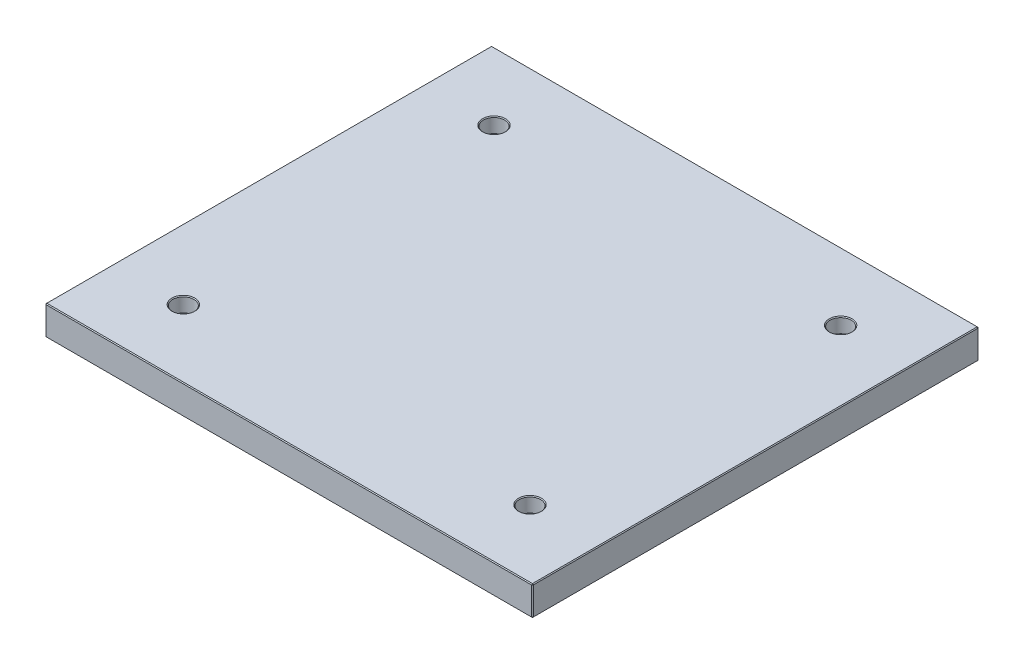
ISO-10303-21;
HEADER;
FILE_DESCRIPTION(('STEP AP214'),'2;1');
FILE_NAME('part.step','',(''),(''),'','','');
FILE_SCHEMA(('AUTOMOTIVE_DESIGN { 1 0 10303 214 1 1 1 1 }'));
ENDSEC;
DATA;
#1=APPLICATION_CONTEXT('core data for automotive mechanical design processes');
#2=APPLICATION_PROTOCOL_DEFINITION('international standard','automotive_design',2000,#1);
#3=PRODUCT_CONTEXT('',#1,'mechanical');
#4=PRODUCT('Part','Part','',(#3));
#5=PRODUCT_RELATED_PRODUCT_CATEGORY('part','',(#4));
#6=PRODUCT_DEFINITION_FORMATION('','',#4);
#7=PRODUCT_DEFINITION_CONTEXT('part definition',#1,'design');
#8=PRODUCT_DEFINITION('design','',#6,#7);
#9=PRODUCT_DEFINITION_SHAPE('','',#8);
#10=(LENGTH_UNIT() NAMED_UNIT(*) SI_UNIT(.MILLI.,.METRE.));
#11=(NAMED_UNIT(*) PLANE_ANGLE_UNIT() SI_UNIT($,.RADIAN.));
#12=(NAMED_UNIT(*) SI_UNIT($,.STERADIAN.) SOLID_ANGLE_UNIT());
#13=UNCERTAINTY_MEASURE_WITH_UNIT(LENGTH_MEASURE(1.E-05),#10,'distance_accuracy_value','');
#14=(GEOMETRIC_REPRESENTATION_CONTEXT(3) GLOBAL_UNCERTAINTY_ASSIGNED_CONTEXT((#13)) GLOBAL_UNIT_ASSIGNED_CONTEXT((#10,
#11,#12)) REPRESENTATION_CONTEXT('',''));
#15=CARTESIAN_POINT('',(0.,0.,0.));
#16=DIRECTION('',(0.,0.,1.));
#17=DIRECTION('',(1.,0.,0.));
#18=AXIS2_PLACEMENT_3D('',#15,#16,#17);
#19=CARTESIAN_POINT('',(-298.,36.,273.));
#20=DIRECTION('',(1.,0.,0.));
#21=DIRECTION('',(0.,0.,-1.));
#22=AXIS2_PLACEMENT_3D('',#19,#20,#21);
#23=PLANE('',#22);
#24=DIRECTION('',(0.,-1.,0.));
#25=VECTOR('',#24,1.);
#26=CARTESIAN_POINT('',(-298.,36.,-272.));
#27=LINE('',#26,#25);
#28=CARTESIAN_POINT('',(-298.,35.,-272.));
#29=VERTEX_POINT('',#28);
#30=CARTESIAN_POINT('',(-298.,1.,-272.));
#31=VERTEX_POINT('',#30);
#32=EDGE_CURVE('E115',#29,#31,#27,.T.);
#33=ORIENTED_EDGE('',*,*,#32,.T.);
#34=DIRECTION('',(0.,0.,1.));
#35=VECTOR('',#34,1.);
#36=CARTESIAN_POINT('',(-298.,1.,273.));
#37=LINE('',#36,#35);
#38=CARTESIAN_POINT('',(-298.,1.,272.));
#39=VERTEX_POINT('',#38);
#40=EDGE_CURVE('E111',#31,#39,#37,.T.);
#41=ORIENTED_EDGE('',*,*,#40,.T.);
#42=DIRECTION('',(0.,1.,0.));
#43=VECTOR('',#42,1.);
#44=CARTESIAN_POINT('',(-298.,36.,272.));
#45=LINE('',#44,#43);
#46=CARTESIAN_POINT('',(-298.,35.,272.));
#47=VERTEX_POINT('',#46);
#48=EDGE_CURVE('E104',#39,#47,#45,.T.);
#49=ORIENTED_EDGE('',*,*,#48,.T.);
#50=DIRECTION('',(0.,0.,-1.));
#51=VECTOR('',#50,1.);
#52=CARTESIAN_POINT('',(-298.,35.,-273.));
#53=LINE('',#52,#51);
#54=EDGE_CURVE('E108',#47,#29,#53,.T.);
#55=ORIENTED_EDGE('',*,*,#54,.T.);
#56=EDGE_LOOP('',(#33,#41,#49,#55));
#57=FACE_BOUND('',#56,.T.);
#58=ADVANCED_FACE('F16',(#57),#23,.F.);
#59=CARTESIAN_POINT('',(298.,36.,273.));
#60=DIRECTION('',(0.,0.,-1.));
#61=DIRECTION('',(-1.,0.,0.));
#62=AXIS2_PLACEMENT_3D('',#59,#60,#61);
#63=PLANE('',#62);
#64=DIRECTION('',(-1.,0.,0.));
#65=VECTOR('',#64,1.);
#66=CARTESIAN_POINT('',(-298.,35.,273.));
#67=LINE('',#66,#65);
#68=CARTESIAN_POINT('',(297.,35.,273.));
#69=VERTEX_POINT('',#68);
#70=CARTESIAN_POINT('',(-297.,35.,273.));
#71=VERTEX_POINT('',#70);
#72=EDGE_CURVE('E170',#69,#71,#67,.T.);
#73=ORIENTED_EDGE('',*,*,#72,.T.);
#74=DIRECTION('',(0.,-1.,0.));
#75=VECTOR('',#74,1.);
#76=CARTESIAN_POINT('',(-297.,36.,273.));
#77=LINE('',#76,#75);
#78=CARTESIAN_POINT('',(-297.,1.,273.));
#79=VERTEX_POINT('',#78);
#80=EDGE_CURVE('E123',#71,#79,#77,.T.);
#81=ORIENTED_EDGE('',*,*,#80,.T.);
#82=DIRECTION('',(1.,0.,0.));
#83=VECTOR('',#82,1.);
#84=CARTESIAN_POINT('',(298.,1.,273.));
#85=LINE('',#84,#83);
#86=CARTESIAN_POINT('',(297.,1.,273.));
#87=VERTEX_POINT('',#86);
#88=EDGE_CURVE('E174',#79,#87,#85,.T.);
#89=ORIENTED_EDGE('',*,*,#88,.T.);
#90=DIRECTION('',(0.,1.,0.));
#91=VECTOR('',#90,1.);
#92=CARTESIAN_POINT('',(297.,36.,273.));
#93=LINE('',#92,#91);
#94=EDGE_CURVE('E172',#87,#69,#93,.T.);
#95=ORIENTED_EDGE('',*,*,#94,.T.);
#96=EDGE_LOOP('',(#73,#81,#89,#95));
#97=FACE_BOUND('',#96,.T.);
#98=ADVANCED_FACE('F316',(#97),#63,.F.);
#99=CARTESIAN_POINT('',(298.,36.,273.));
#100=DIRECTION('',(-1.,0.,0.));
#101=DIRECTION('',(0.,0.,1.));
#102=AXIS2_PLACEMENT_3D('',#99,#100,#101);
#103=PLANE('',#102);
#104=DIRECTION('',(0.,0.,-1.));
#105=VECTOR('',#104,1.);
#106=CARTESIAN_POINT('',(298.,1.,273.));
#107=LINE('',#106,#105);
#108=CARTESIAN_POINT('',(298.,1.,272.));
#109=VERTEX_POINT('',#108);
#110=CARTESIAN_POINT('',(298.,1.,-272.));
#111=VERTEX_POINT('',#110);
#112=EDGE_CURVE('E165',#109,#111,#107,.T.);
#113=ORIENTED_EDGE('',*,*,#112,.T.);
#114=DIRECTION('',(0.,1.,0.));
#115=VECTOR('',#114,1.);
#116=CARTESIAN_POINT('',(298.,36.,-272.));
#117=LINE('',#116,#115);
#118=CARTESIAN_POINT('',(298.,35.,-272.));
#119=VERTEX_POINT('',#118);
#120=EDGE_CURVE('E167',#111,#119,#117,.T.);
#121=ORIENTED_EDGE('',*,*,#120,.T.);
#122=DIRECTION('',(0.,0.,1.));
#123=VECTOR('',#122,1.);
#124=CARTESIAN_POINT('',(298.,35.,273.));
#125=LINE('',#124,#123);
#126=CARTESIAN_POINT('',(298.,35.,272.));
#127=VERTEX_POINT('',#126);
#128=EDGE_CURVE('E161',#119,#127,#125,.T.);
#129=ORIENTED_EDGE('',*,*,#128,.T.);
#130=DIRECTION('',(0.,-1.,0.));
#131=VECTOR('',#130,1.);
#132=CARTESIAN_POINT('',(298.,36.,272.));
#133=LINE('',#132,#131);
#134=EDGE_CURVE('E163',#127,#109,#133,.T.);
#135=ORIENTED_EDGE('',*,*,#134,.T.);
#136=EDGE_LOOP('',(#113,#121,#129,#135));
#137=FACE_BOUND('',#136,.T.);
#138=ADVANCED_FACE('F321',(#137),#103,.F.);
#139=CARTESIAN_POINT('',(298.,36.,-273.));
#140=DIRECTION('',(0.,0.,1.));
#141=DIRECTION('',(1.,0.,0.));
#142=AXIS2_PLACEMENT_3D('',#139,#140,#141);
#143=PLANE('',#142);
#144=DIRECTION('',(0.,-1.,0.));
#145=VECTOR('',#144,1.);
#146=CARTESIAN_POINT('',(297.,36.,-273.));
#147=LINE('',#146,#145);
#148=CARTESIAN_POINT('',(297.,35.,-273.));
#149=VERTEX_POINT('',#148);
#150=CARTESIAN_POINT('',(297.,1.,-273.));
#151=VERTEX_POINT('',#150);
#152=EDGE_CURVE('E154',#149,#151,#147,.T.);
#153=ORIENTED_EDGE('',*,*,#152,.T.);
#154=DIRECTION('',(-1.,0.,0.));
#155=VECTOR('',#154,1.);
#156=CARTESIAN_POINT('',(298.,1.,-273.));
#157=LINE('',#156,#155);
#158=CARTESIAN_POINT('',(-297.,1.,-273.));
#159=VERTEX_POINT('',#158);
#160=EDGE_CURVE('E159',#151,#159,#157,.T.);
#161=ORIENTED_EDGE('',*,*,#160,.T.);
#162=DIRECTION('',(0.,1.,0.));
#163=VECTOR('',#162,1.);
#164=CARTESIAN_POINT('',(-297.,36.,-273.));
#165=LINE('',#164,#163);
#166=CARTESIAN_POINT('',(-297.,35.,-273.));
#167=VERTEX_POINT('',#166);
#168=EDGE_CURVE('E156',#159,#167,#165,.T.);
#169=ORIENTED_EDGE('',*,*,#168,.T.);
#170=DIRECTION('',(1.,0.,0.));
#171=VECTOR('',#170,1.);
#172=CARTESIAN_POINT('',(298.,35.,-273.));
#173=LINE('',#172,#171);
#174=EDGE_CURVE('E152',#167,#149,#173,.T.);
#175=ORIENTED_EDGE('',*,*,#174,.T.);
#176=EDGE_LOOP('',(#153,#161,#169,#175));
#177=FACE_BOUND('',#176,.T.);
#178=ADVANCED_FACE('F461',(#177),#143,.F.);
#179=CARTESIAN_POINT('',(0.,36.,0.));
#180=DIRECTION('',(0.,1.,0.));
#181=DIRECTION('',(0.,0.,1.));
#182=AXIS2_PLACEMENT_3D('',#179,#180,#181);
#183=PLANE('',#182);
#184=CARTESIAN_POINT('',(-212.,36.,190.));
#185=DIRECTION('',(0.,1.,0.));
#186=DIRECTION('',(0.,0.,1.));
#187=AXIS2_PLACEMENT_3D('',#184,#185,#186);
#188=CIRCLE('',#187,14.);
#189=CARTESIAN_POINT('',(-212.,36.,204.));
#190=VERTEX_POINT('',#189);
#191=EDGE_CURVE('E290',#190,#190,#188,.F.);
#192=ORIENTED_EDGE('',*,*,#191,.T.);
#193=EDGE_LOOP('',(#192));
#194=FACE_BOUND('',#193,.T.);
#195=CARTESIAN_POINT('',(212.,36.,190.));
#196=DIRECTION('',(0.,1.,0.));
#197=DIRECTION('',(0.,0.,1.));
#198=AXIS2_PLACEMENT_3D('',#195,#196,#197);
#199=CIRCLE('',#198,14.);
#200=CARTESIAN_POINT('',(212.,36.,204.));
#201=VERTEX_POINT('',#200);
#202=EDGE_CURVE('E287',#201,#201,#199,.F.);
#203=ORIENTED_EDGE('',*,*,#202,.T.);
#204=EDGE_LOOP('',(#203));
#205=FACE_BOUND('',#204,.T.);
#206=CARTESIAN_POINT('',(212.,36.,-190.));
#207=DIRECTION('',(0.,1.,0.));
#208=DIRECTION('',(0.,0.,1.));
#209=AXIS2_PLACEMENT_3D('',#206,#207,#208);
#210=CIRCLE('',#209,14.);
#211=CARTESIAN_POINT('',(212.,36.,-176.));
#212=VERTEX_POINT('',#211);
#213=EDGE_CURVE('E284',#212,#212,#210,.F.);
#214=ORIENTED_EDGE('',*,*,#213,.T.);
#215=EDGE_LOOP('',(#214));
#216=FACE_BOUND('',#215,.T.);
#217=CARTESIAN_POINT('',(-212.,36.,-190.));
#218=DIRECTION('',(0.,1.,0.));
#219=DIRECTION('',(0.,0.,1.));
#220=AXIS2_PLACEMENT_3D('',#217,#218,#219);
#221=CIRCLE('',#220,14.);
#222=CARTESIAN_POINT('',(-212.,36.,-176.));
#223=VERTEX_POINT('',#222);
#224=EDGE_CURVE('E281',#223,#223,#221,.F.);
#225=ORIENTED_EDGE('',*,*,#224,.T.);
#226=EDGE_LOOP('',(#225));
#227=FACE_BOUND('',#226,.T.);
#228=DIRECTION('',(0.,0.,-1.));
#229=VECTOR('',#228,1.);
#230=CARTESIAN_POINT('',(297.,36.,-273.));
#231=LINE('',#230,#229);
#232=CARTESIAN_POINT('',(297.,36.,272.));
#233=VERTEX_POINT('',#232);
#234=CARTESIAN_POINT('',(297.,36.,-272.));
#235=VERTEX_POINT('',#234);
#236=EDGE_CURVE('E31',#233,#235,#231,.T.);
#237=ORIENTED_EDGE('',*,*,#236,.T.);
#238=DIRECTION('',(-1.,0.,0.));
#239=VECTOR('',#238,1.);
#240=CARTESIAN_POINT('',(-298.,36.,-272.));
#241=LINE('',#240,#239);
#242=CARTESIAN_POINT('',(-297.,36.,-272.));
#243=VERTEX_POINT('',#242);
#244=EDGE_CURVE('E190',#235,#243,#241,.T.);
#245=ORIENTED_EDGE('',*,*,#244,.T.);
#246=DIRECTION('',(0.,0.,1.));
#247=VECTOR('',#246,1.);
#248=CARTESIAN_POINT('',(-297.,36.,273.));
#249=LINE('',#248,#247);
#250=CARTESIAN_POINT('',(-297.,36.,272.));
#251=VERTEX_POINT('',#250);
#252=EDGE_CURVE('E186',#243,#251,#249,.T.);
#253=ORIENTED_EDGE('',*,*,#252,.T.);
#254=DIRECTION('',(1.,0.,0.));
#255=VECTOR('',#254,1.);
#256=CARTESIAN_POINT('',(298.,36.,272.));
#257=LINE('',#256,#255);
#258=EDGE_CURVE('E36',#251,#233,#257,.T.);
#259=ORIENTED_EDGE('',*,*,#258,.T.);
#260=EDGE_LOOP('',(#237,#245,#253,#259));
#261=FACE_BOUND('',#260,.T.);
#262=ADVANCED_FACE('F458',(#194,#205,#216,#227,#261),#183,.T.);
#263=CARTESIAN_POINT('',(0.,0.,0.));
#264=DIRECTION('',(0.,1.,0.));
#265=DIRECTION('',(0.,0.,1.));
#266=AXIS2_PLACEMENT_3D('',#263,#264,#265);
#267=PLANE('',#266);
#268=CARTESIAN_POINT('',(212.,0.,-190.));
#269=DIRECTION('',(0.,1.,0.));
#270=DIRECTION('',(0.,0.,1.));
#271=AXIS2_PLACEMENT_3D('',#268,#269,#270);
#272=CIRCLE('',#271,10.);
#273=CARTESIAN_POINT('',(212.,0.,-180.));
#274=VERTEX_POINT('',#273);
#275=EDGE_CURVE('E263',#274,#274,#272,.T.);
#276=ORIENTED_EDGE('',*,*,#275,.T.);
#277=EDGE_LOOP('',(#276));
#278=FACE_BOUND('',#277,.T.);
#279=CARTESIAN_POINT('',(212.,0.,190.));
#280=DIRECTION('',(0.,1.,0.));
#281=DIRECTION('',(0.,0.,1.));
#282=AXIS2_PLACEMENT_3D('',#279,#280,#281);
#283=CIRCLE('',#282,10.);
#284=CARTESIAN_POINT('',(212.,0.,200.));
#285=VERTEX_POINT('',#284);
#286=EDGE_CURVE('E260',#285,#285,#283,.T.);
#287=ORIENTED_EDGE('',*,*,#286,.T.);
#288=EDGE_LOOP('',(#287));
#289=FACE_BOUND('',#288,.T.);
#290=CARTESIAN_POINT('',(-212.,0.,190.));
#291=DIRECTION('',(0.,1.,0.));
#292=DIRECTION('',(0.,0.,1.));
#293=AXIS2_PLACEMENT_3D('',#290,#291,#292);
#294=CIRCLE('',#293,10.);
#295=CARTESIAN_POINT('',(-212.,0.,200.));
#296=VERTEX_POINT('',#295);
#297=EDGE_CURVE('E257',#296,#296,#294,.T.);
#298=ORIENTED_EDGE('',*,*,#297,.T.);
#299=EDGE_LOOP('',(#298));
#300=FACE_BOUND('',#299,.T.);
#301=CARTESIAN_POINT('',(-212.,0.,-190.));
#302=DIRECTION('',(0.,1.,0.));
#303=DIRECTION('',(0.,0.,1.));
#304=AXIS2_PLACEMENT_3D('',#301,#302,#303);
#305=CIRCLE('',#304,10.);
#306=CARTESIAN_POINT('',(-212.,0.,-180.));
#307=VERTEX_POINT('',#306);
#308=EDGE_CURVE('E192',#307,#307,#305,.T.);
#309=ORIENTED_EDGE('',*,*,#308,.T.);
#310=EDGE_LOOP('',(#309));
#311=FACE_BOUND('',#310,.T.);
#312=DIRECTION('',(0.,0.,1.));
#313=VECTOR('',#312,1.);
#314=CARTESIAN_POINT('',(297.,0.,0.));
#315=LINE('',#314,#313);
#316=CARTESIAN_POINT('',(297.,0.,-272.));
#317=VERTEX_POINT('',#316);
#318=CARTESIAN_POINT('',(297.,0.,272.));
#319=VERTEX_POINT('',#318);
#320=EDGE_CURVE('E177',#317,#319,#315,.T.);
#321=ORIENTED_EDGE('',*,*,#320,.T.);
#322=DIRECTION('',(-1.,0.,0.));
#323=VECTOR('',#322,1.);
#324=CARTESIAN_POINT('',(0.,0.,272.));
#325=LINE('',#324,#323);
#326=CARTESIAN_POINT('',(-297.,0.,272.));
#327=VERTEX_POINT('',#326);
#328=EDGE_CURVE('E183',#319,#327,#325,.T.);
#329=ORIENTED_EDGE('',*,*,#328,.T.);
#330=DIRECTION('',(0.,0.,-1.));
#331=VECTOR('',#330,1.);
#332=CARTESIAN_POINT('',(-297.,0.,0.));
#333=LINE('',#332,#331);
#334=CARTESIAN_POINT('',(-297.,0.,-272.));
#335=VERTEX_POINT('',#334);
#336=EDGE_CURVE('E181',#327,#335,#333,.T.);
#337=ORIENTED_EDGE('',*,*,#336,.T.);
#338=DIRECTION('',(1.,0.,0.));
#339=VECTOR('',#338,1.);
#340=CARTESIAN_POINT('',(0.,0.,-272.));
#341=LINE('',#340,#339);
#342=EDGE_CURVE('E179',#335,#317,#341,.T.);
#343=ORIENTED_EDGE('',*,*,#342,.T.);
#344=EDGE_LOOP('',(#321,#329,#337,#343));
#345=FACE_BOUND('',#344,.T.);
#346=ADVANCED_FACE('F400',(#278,#289,#300,#311,#345),#267,.F.);
#347=CARTESIAN_POINT('',(298.,36.,272.));
#348=DIRECTION('',(-0.707106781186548,0.,-0.707106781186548));
#349=DIRECTION('',(0.,-1.,0.));
#350=AXIS2_PLACEMENT_3D('',#347,#348,#349);
#351=PLANE('',#350);
#352=DIRECTION('',(-0.707106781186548,0.,0.707106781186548));
#353=VECTOR('',#352,1.);
#354=CARTESIAN_POINT('',(297.,35.,273.));
#355=LINE('',#354,#353);
#356=EDGE_CURVE('E141',#69,#127,#355,.F.);
#357=ORIENTED_EDGE('',*,*,#356,.F.);
#358=ORIENTED_EDGE('',*,*,#94,.F.);
#359=DIRECTION('',(0.707106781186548,0.,-0.707106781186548));
#360=VECTOR('',#359,1.);
#361=CARTESIAN_POINT('',(297.,1.,273.));
#362=LINE('',#361,#360);
#363=EDGE_CURVE('E144',#109,#87,#362,.F.);
#364=ORIENTED_EDGE('',*,*,#363,.F.);
#365=ORIENTED_EDGE('',*,*,#134,.F.);
#366=EDGE_LOOP('',(#357,#358,#364,#365));
#367=FACE_BOUND('',#366,.T.);
#368=ADVANCED_FACE('F396',(#367),#351,.F.);
#369=CARTESIAN_POINT('',(297.,35.,273.));
#370=DIRECTION('',(0.577350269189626,0.577350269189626,0.577350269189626));
#371=DIRECTION('',(0.707106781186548,0.,-0.707106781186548));
#372=AXIS2_PLACEMENT_3D('',#369,#370,#371);
#373=PLANE('',#372);
#374=DIRECTION('',(0.,-0.707106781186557,0.707106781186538));
#375=VECTOR('',#374,1.);
#376=CARTESIAN_POINT('',(297.,35.,273.));
#377=LINE('',#376,#375);
#378=EDGE_CURVE('E235',#69,#233,#377,.F.);
#379=ORIENTED_EDGE('',*,*,#378,.F.);
#380=ORIENTED_EDGE('',*,*,#356,.T.);
#381=DIRECTION('',(-0.707106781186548,0.707106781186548,0.));
#382=VECTOR('',#381,1.);
#383=CARTESIAN_POINT('',(297.5,35.5,272.));
#384=LINE('',#383,#382);
#385=EDGE_CURVE('E237',#233,#127,#384,.F.);
#386=ORIENTED_EDGE('',*,*,#385,.F.);
#387=EDGE_LOOP('',(#379,#380,#386));
#388=FACE_BOUND('',#387,.T.);
#389=ADVANCED_FACE('F392',(#388),#373,.T.);
#390=CARTESIAN_POINT('',(297.,1.,273.));
#391=DIRECTION('',(0.577350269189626,-0.577350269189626,0.577350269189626));
#392=DIRECTION('',(0.707106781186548,0.,-0.707106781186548));
#393=AXIS2_PLACEMENT_3D('',#390,#391,#392);
#394=PLANE('',#393);
#395=DIRECTION('',(-0.707106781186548,-0.707106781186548,0.));
#396=VECTOR('',#395,1.);
#397=CARTESIAN_POINT('',(297.5,0.5,272.));
#398=LINE('',#397,#396);
#399=EDGE_CURVE('E229',#109,#319,#398,.T.);
#400=ORIENTED_EDGE('',*,*,#399,.F.);
#401=ORIENTED_EDGE('',*,*,#363,.T.);
#402=DIRECTION('',(0.,0.707106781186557,0.707106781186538));
#403=VECTOR('',#402,1.);
#404=CARTESIAN_POINT('',(297.,1.,273.));
#405=LINE('',#404,#403);
#406=EDGE_CURVE('E232',#319,#87,#405,.T.);
#407=ORIENTED_EDGE('',*,*,#406,.F.);
#408=EDGE_LOOP('',(#400,#401,#407));
#409=FACE_BOUND('',#408,.T.);
#410=ADVANCED_FACE('F388',(#409),#394,.T.);
#411=CARTESIAN_POINT('',(297.,36.,0.));
#412=DIRECTION('',(0.707106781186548,0.707106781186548,0.));
#413=DIRECTION('',(0.,0.,1.));
#414=AXIS2_PLACEMENT_3D('',#411,#412,#413);
#415=PLANE('',#414);
#416=ORIENTED_EDGE('',*,*,#385,.T.);
#417=ORIENTED_EDGE('',*,*,#128,.F.);
#418=DIRECTION('',(0.707106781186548,-0.707106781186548,0.));
#419=VECTOR('',#418,1.);
#420=CARTESIAN_POINT('',(298.,35.,-272.));
#421=LINE('',#420,#419);
#422=EDGE_CURVE('E224',#235,#119,#421,.T.);
#423=ORIENTED_EDGE('',*,*,#422,.F.);
#424=ORIENTED_EDGE('',*,*,#236,.F.);
#425=EDGE_LOOP('',(#416,#417,#423,#424));
#426=FACE_BOUND('',#425,.T.);
#427=ADVANCED_FACE('F384',(#426),#415,.T.);
#428=CARTESIAN_POINT('',(0.,36.,272.));
#429=DIRECTION('',(0.,0.707106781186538,0.707106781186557));
#430=DIRECTION('',(-1.,0.,0.));
#431=AXIS2_PLACEMENT_3D('',#428,#429,#430);
#432=PLANE('',#431);
#433=ORIENTED_EDGE('',*,*,#378,.T.);
#434=ORIENTED_EDGE('',*,*,#258,.F.);
#435=DIRECTION('',(0.,0.707106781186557,-0.707106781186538));
#436=VECTOR('',#435,1.);
#437=CARTESIAN_POINT('',(-297.,35.5,272.5));
#438=LINE('',#437,#436);
#439=EDGE_CURVE('E127',#71,#251,#438,.T.);
#440=ORIENTED_EDGE('',*,*,#439,.F.);
#441=ORIENTED_EDGE('',*,*,#72,.F.);
#442=EDGE_LOOP('',(#433,#434,#440,#441));
#443=FACE_BOUND('',#442,.T.);
#444=ADVANCED_FACE('F381',(#443),#432,.T.);
#445=CARTESIAN_POINT('',(-297.,36.,273.));
#446=DIRECTION('',(0.707106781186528,0.,-0.707106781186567));
#447=DIRECTION('',(0.,-1.,0.));
#448=AXIS2_PLACEMENT_3D('',#445,#446,#447);
#449=PLANE('',#448);
#450=DIRECTION('',(0.707106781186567,0.,0.707106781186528));
#451=VECTOR('',#450,1.);
#452=CARTESIAN_POINT('',(-297.,1.,273.));
#453=LINE('',#452,#451);
#454=EDGE_CURVE('E128',#79,#39,#453,.F.);
#455=ORIENTED_EDGE('',*,*,#454,.F.);
#456=ORIENTED_EDGE('',*,*,#80,.F.);
#457=DIRECTION('',(-0.707106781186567,0.,-0.707106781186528));
#458=VECTOR('',#457,1.);
#459=CARTESIAN_POINT('',(-298.,35.,272.));
#460=LINE('',#459,#458);
#461=EDGE_CURVE('E119',#47,#71,#460,.F.);
#462=ORIENTED_EDGE('',*,*,#461,.F.);
#463=ORIENTED_EDGE('',*,*,#48,.F.);
#464=EDGE_LOOP('',(#455,#456,#462,#463));
#465=FACE_BOUND('',#464,.T.);
#466=ADVANCED_FACE('F121',(#465),#449,.F.);
#467=CARTESIAN_POINT('',(298.,1.,273.));
#468=DIRECTION('',(0.,0.707106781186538,-0.707106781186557));
#469=DIRECTION('',(1.,0.,0.));
#470=AXIS2_PLACEMENT_3D('',#467,#468,#469);
#471=PLANE('',#470);
#472=ORIENTED_EDGE('',*,*,#406,.T.);
#473=ORIENTED_EDGE('',*,*,#88,.F.);
#474=DIRECTION('',(0.,-0.707106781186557,-0.707106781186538));
#475=VECTOR('',#474,1.);
#476=CARTESIAN_POINT('',(-297.,1.,273.));
#477=LINE('',#476,#475);
#478=EDGE_CURVE('E220',#327,#79,#477,.F.);
#479=ORIENTED_EDGE('',*,*,#478,.F.);
#480=ORIENTED_EDGE('',*,*,#328,.F.);
#481=EDGE_LOOP('',(#472,#473,#479,#480));
#482=FACE_BOUND('',#481,.T.);
#483=ADVANCED_FACE('F374',(#482),#471,.F.);
#484=CARTESIAN_POINT('',(298.,1.,273.));
#485=DIRECTION('',(-0.707106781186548,0.707106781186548,0.));
#486=DIRECTION('',(0.,0.,-1.));
#487=AXIS2_PLACEMENT_3D('',#484,#485,#486);
#488=PLANE('',#487);
#489=ORIENTED_EDGE('',*,*,#399,.T.);
#490=ORIENTED_EDGE('',*,*,#320,.F.);
#491=DIRECTION('',(0.707106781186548,0.707106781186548,0.));
#492=VECTOR('',#491,1.);
#493=CARTESIAN_POINT('',(297.5,0.500000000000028,-272.));
#494=LINE('',#493,#492);
#495=EDGE_CURVE('E217',#111,#317,#494,.F.);
#496=ORIENTED_EDGE('',*,*,#495,.F.);
#497=ORIENTED_EDGE('',*,*,#112,.F.);
#498=EDGE_LOOP('',(#489,#490,#496,#497));
#499=FACE_BOUND('',#498,.T.);
#500=ADVANCED_FACE('F370',(#499),#488,.F.);
#501=CARTESIAN_POINT('',(297.,36.,-273.));
#502=DIRECTION('',(-0.707106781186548,0.,0.707106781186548));
#503=DIRECTION('',(0.,-1.,0.));
#504=AXIS2_PLACEMENT_3D('',#501,#502,#503);
#505=PLANE('',#504);
#506=DIRECTION('',(0.707106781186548,0.,0.707106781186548));
#507=VECTOR('',#506,1.);
#508=CARTESIAN_POINT('',(298.,35.,-272.));
#509=LINE('',#508,#507);
#510=EDGE_CURVE('E226',#119,#149,#509,.F.);
#511=ORIENTED_EDGE('',*,*,#510,.F.);
#512=ORIENTED_EDGE('',*,*,#120,.F.);
#513=DIRECTION('',(-0.707106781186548,0.,-0.707106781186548));
#514=VECTOR('',#513,1.);
#515=CARTESIAN_POINT('',(297.,1.,-273.));
#516=LINE('',#515,#514);
#517=EDGE_CURVE('E214',#151,#111,#516,.F.);
#518=ORIENTED_EDGE('',*,*,#517,.F.);
#519=ORIENTED_EDGE('',*,*,#152,.F.);
#520=EDGE_LOOP('',(#511,#512,#518,#519));
#521=FACE_BOUND('',#520,.T.);
#522=ADVANCED_FACE('F366',(#521),#505,.F.);
#523=CARTESIAN_POINT('',(298.,35.,-272.));
#524=DIRECTION('',(0.577350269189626,0.577350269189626,-0.577350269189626));
#525=DIRECTION('',(-0.707106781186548,0.,-0.707106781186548));
#526=AXIS2_PLACEMENT_3D('',#523,#524,#525);
#527=PLANE('',#526);
#528=ORIENTED_EDGE('',*,*,#422,.T.);
#529=ORIENTED_EDGE('',*,*,#510,.T.);
#530=DIRECTION('',(0.,0.707106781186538,0.707106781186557));
#531=VECTOR('',#530,1.);
#532=CARTESIAN_POINT('',(297.,35.5,-272.5));
#533=LINE('',#532,#531);
#534=EDGE_CURVE('E135',#235,#149,#533,.F.);
#535=ORIENTED_EDGE('',*,*,#534,.F.);
#536=EDGE_LOOP('',(#528,#529,#535));
#537=FACE_BOUND('',#536,.T.);
#538=ADVANCED_FACE('F363',(#537),#527,.T.);
#539=CARTESIAN_POINT('',(-298.,35.,272.));
#540=DIRECTION('',(-0.577350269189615,0.577350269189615,0.577350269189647));
#541=DIRECTION('',(0.707106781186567,0.,0.707106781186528));
#542=AXIS2_PLACEMENT_3D('',#539,#540,#541);
#543=PLANE('',#542);
#544=ORIENTED_EDGE('',*,*,#461,.T.);
#545=ORIENTED_EDGE('',*,*,#439,.T.);
#546=DIRECTION('',(-0.707106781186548,-0.707106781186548,0.));
#547=VECTOR('',#546,1.);
#548=CARTESIAN_POINT('',(-298.,35.,272.));
#549=LINE('',#548,#547);
#550=EDGE_CURVE('E131',#47,#251,#549,.F.);
#551=ORIENTED_EDGE('',*,*,#550,.F.);
#552=EDGE_LOOP('',(#544,#545,#551));
#553=FACE_BOUND('',#552,.T.);
#554=ADVANCED_FACE('F132',(#553),#543,.T.);
#555=CARTESIAN_POINT('',(-297.,1.,273.));
#556=DIRECTION('',(-0.577350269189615,-0.577350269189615,0.577350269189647));
#557=DIRECTION('',(0.707106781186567,0.,0.707106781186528));
#558=AXIS2_PLACEMENT_3D('',#555,#556,#557);
#559=PLANE('',#558);
#560=ORIENTED_EDGE('',*,*,#478,.T.);
#561=ORIENTED_EDGE('',*,*,#454,.T.);
#562=DIRECTION('',(-0.707106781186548,0.707106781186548,0.));
#563=VECTOR('',#562,1.);
#564=CARTESIAN_POINT('',(-297.5,0.499999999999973,272.));
#565=LINE('',#564,#563);
#566=EDGE_CURVE('E136',#327,#39,#565,.T.);
#567=ORIENTED_EDGE('',*,*,#566,.F.);
#568=EDGE_LOOP('',(#560,#561,#567));
#569=FACE_BOUND('',#568,.T.);
#570=ADVANCED_FACE('F356',(#569),#559,.T.);
#571=CARTESIAN_POINT('',(297.,1.,-273.));
#572=DIRECTION('',(0.577350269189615,-0.577350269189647,-0.577350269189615));
#573=DIRECTION('',(0.,0.707106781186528,-0.707106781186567));
#574=AXIS2_PLACEMENT_3D('',#571,#572,#573);
#575=PLANE('',#574);
#576=ORIENTED_EDGE('',*,*,#517,.T.);
#577=ORIENTED_EDGE('',*,*,#495,.T.);
#578=DIRECTION('',(0.,-0.707106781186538,0.707106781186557));
#579=VECTOR('',#578,1.);
#580=CARTESIAN_POINT('',(297.,1.,-273.));
#581=LINE('',#580,#579);
#582=EDGE_CURVE('E207',#151,#317,#581,.T.);
#583=ORIENTED_EDGE('',*,*,#582,.F.);
#584=EDGE_LOOP('',(#576,#577,#583));
#585=FACE_BOUND('',#584,.T.);
#586=ADVANCED_FACE('F352',(#585),#575,.T.);
#587=CARTESIAN_POINT('',(0.,36.,-272.));
#588=DIRECTION('',(0.,0.707106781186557,-0.707106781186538));
#589=DIRECTION('',(1.,0.,0.));
#590=AXIS2_PLACEMENT_3D('',#587,#588,#589);
#591=PLANE('',#590);
#592=ORIENTED_EDGE('',*,*,#534,.T.);
#593=ORIENTED_EDGE('',*,*,#174,.F.);
#594=DIRECTION('',(0.,-0.707106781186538,-0.707106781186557));
#595=VECTOR('',#594,1.);
#596=CARTESIAN_POINT('',(-297.,35.,-273.));
#597=LINE('',#596,#595);
#598=EDGE_CURVE('E204',#243,#167,#597,.T.);
#599=ORIENTED_EDGE('',*,*,#598,.F.);
#600=ORIENTED_EDGE('',*,*,#244,.F.);
#601=EDGE_LOOP('',(#592,#593,#599,#600));
#602=FACE_BOUND('',#601,.T.);
#603=ADVANCED_FACE('F349',(#602),#591,.T.);
#604=CARTESIAN_POINT('',(-297.,36.,0.));
#605=DIRECTION('',(-0.707106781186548,0.707106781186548,0.));
#606=DIRECTION('',(0.,0.,-1.));
#607=AXIS2_PLACEMENT_3D('',#604,#605,#606);
#608=PLANE('',#607);
#609=ORIENTED_EDGE('',*,*,#550,.T.);
#610=ORIENTED_EDGE('',*,*,#252,.F.);
#611=DIRECTION('',(0.707106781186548,0.707106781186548,0.));
#612=VECTOR('',#611,1.);
#613=CARTESIAN_POINT('',(-297.5,35.5,-272.));
#614=LINE('',#613,#612);
#615=EDGE_CURVE('E139',#29,#243,#614,.T.);
#616=ORIENTED_EDGE('',*,*,#615,.F.);
#617=ORIENTED_EDGE('',*,*,#54,.F.);
#618=EDGE_LOOP('',(#609,#610,#616,#617));
#619=FACE_BOUND('',#618,.T.);
#620=ADVANCED_FACE('F138',(#619),#608,.T.);
#621=CARTESIAN_POINT('',(-298.,1.,273.));
#622=DIRECTION('',(0.707106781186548,0.707106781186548,0.));
#623=DIRECTION('',(0.,0.,1.));
#624=AXIS2_PLACEMENT_3D('',#621,#622,#623);
#625=PLANE('',#624);
#626=ORIENTED_EDGE('',*,*,#566,.T.);
#627=ORIENTED_EDGE('',*,*,#40,.F.);
#628=DIRECTION('',(0.707106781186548,-0.707106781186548,1.17611407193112E-13));
#629=VECTOR('',#628,1.);
#630=CARTESIAN_POINT('',(-298.,1.,-272.));
#631=LINE('',#630,#629);
#632=EDGE_CURVE('E200',#335,#31,#631,.F.);
#633=ORIENTED_EDGE('',*,*,#632,.F.);
#634=ORIENTED_EDGE('',*,*,#336,.F.);
#635=EDGE_LOOP('',(#626,#627,#633,#634));
#636=FACE_BOUND('',#635,.T.);
#637=ADVANCED_FACE('F342',(#636),#625,.F.);
#638=CARTESIAN_POINT('',(298.,1.,-273.));
#639=DIRECTION('',(0.,0.707106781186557,0.707106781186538));
#640=DIRECTION('',(-1.,0.,0.));
#641=AXIS2_PLACEMENT_3D('',#638,#639,#640);
#642=PLANE('',#641);
#643=ORIENTED_EDGE('',*,*,#582,.T.);
#644=ORIENTED_EDGE('',*,*,#342,.F.);
#645=DIRECTION('',(0.,0.707106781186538,-0.707106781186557));
#646=VECTOR('',#645,1.);
#647=CARTESIAN_POINT('',(-297.,0.500000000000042,-272.5));
#648=LINE('',#647,#646);
#649=EDGE_CURVE('E197',#159,#335,#648,.F.);
#650=ORIENTED_EDGE('',*,*,#649,.F.);
#651=ORIENTED_EDGE('',*,*,#160,.F.);
#652=EDGE_LOOP('',(#643,#644,#650,#651));
#653=FACE_BOUND('',#652,.T.);
#654=ADVANCED_FACE('F338',(#653),#642,.F.);
#655=CARTESIAN_POINT('',(-297.,35.,-273.));
#656=DIRECTION('',(-0.577350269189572,0.577350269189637,-0.577350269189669));
#657=DIRECTION('',(0.,0.707106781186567,0.707106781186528));
#658=AXIS2_PLACEMENT_3D('',#655,#656,#657);
#659=PLANE('',#658);
#660=ORIENTED_EDGE('',*,*,#615,.T.);
#661=ORIENTED_EDGE('',*,*,#598,.T.);
#662=DIRECTION('',(0.707106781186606,0.,-0.707106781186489));
#663=VECTOR('',#662,1.);
#664=CARTESIAN_POINT('',(-297.,35.,-273.));
#665=LINE('',#664,#663);
#666=EDGE_CURVE('E195',#29,#167,#665,.T.);
#667=ORIENTED_EDGE('',*,*,#666,.F.);
#668=EDGE_LOOP('',(#660,#661,#667));
#669=FACE_BOUND('',#668,.T.);
#670=ADVANCED_FACE('F334',(#669),#659,.T.);
#671=CARTESIAN_POINT('',(-298.,1.,-272.));
#672=DIRECTION('',(-0.577350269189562,-0.577350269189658,-0.577350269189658));
#673=DIRECTION('',(0.,0.707106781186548,-0.707106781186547));
#674=AXIS2_PLACEMENT_3D('',#671,#672,#673);
#675=PLANE('',#674);
#676=ORIENTED_EDGE('',*,*,#649,.T.);
#677=ORIENTED_EDGE('',*,*,#632,.T.);
#678=DIRECTION('',(-0.707106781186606,0.,0.707106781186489));
#679=VECTOR('',#678,1.);
#680=CARTESIAN_POINT('',(-298.,1.,-272.));
#681=LINE('',#680,#679);
#682=EDGE_CURVE('E193',#159,#31,#681,.T.);
#683=ORIENTED_EDGE('',*,*,#682,.F.);
#684=EDGE_LOOP('',(#676,#677,#683));
#685=FACE_BOUND('',#684,.T.);
#686=ADVANCED_FACE('F330',(#685),#675,.T.);
#687=CARTESIAN_POINT('',(-298.,36.,-272.));
#688=DIRECTION('',(0.707106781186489,0.,0.707106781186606));
#689=DIRECTION('',(0.,-1.,0.));
#690=AXIS2_PLACEMENT_3D('',#687,#688,#689);
#691=PLANE('',#690);
#692=ORIENTED_EDGE('',*,*,#666,.T.);
#693=ORIENTED_EDGE('',*,*,#168,.F.);
#694=ORIENTED_EDGE('',*,*,#682,.T.);
#695=ORIENTED_EDGE('',*,*,#32,.F.);
#696=EDGE_LOOP('',(#692,#693,#694,#695));
#697=FACE_BOUND('',#696,.T.);
#698=ADVANCED_FACE('F326',(#697),#691,.F.);
#699=CARTESIAN_POINT('',(-212.,18.,-190.));
#700=DIRECTION('',(0.,1.,0.));
#701=DIRECTION('',(0.,0.,1.));
#702=AXIS2_PLACEMENT_3D('',#699,#700,#701);
#703=CYLINDRICAL_SURFACE('',#702,13.);
#704=CARTESIAN_POINT('',(-212.,35.,-190.));
#705=DIRECTION('',(0.,1.,0.));
#706=DIRECTION('',(0.,0.,1.));
#707=AXIS2_PLACEMENT_3D('',#704,#705,#706);
#708=CIRCLE('',#707,13.);
#709=CARTESIAN_POINT('',(-212.,35.,-177.));
#710=VERTEX_POINT('',#709);
#711=EDGE_CURVE('E10',#710,#710,#708,.T.);
#712=ORIENTED_EDGE('',*,*,#711,.T.);
#713=EDGE_LOOP('',(#712));
#714=FACE_BOUND('',#713,.T.);
#715=CARTESIAN_POINT('',(-212.,18.,-190.));
#716=DIRECTION('',(0.,1.,0.));
#717=DIRECTION('',(0.,0.,1.));
#718=AXIS2_PLACEMENT_3D('',#715,#716,#717);
#719=CIRCLE('',#718,13.);
#720=CARTESIAN_POINT('',(-212.,18.,-177.));
#721=VERTEX_POINT('',#720);
#722=EDGE_CURVE('E147',#721,#721,#719,.T.);
#723=ORIENTED_EDGE('',*,*,#722,.F.);
#724=EDGE_LOOP('',(#723));
#725=FACE_BOUND('',#724,.T.);
#726=ADVANCED_FACE('F329',(#714,#725),#703,.F.);
#727=CARTESIAN_POINT('',(-212.,18.,-190.));
#728=DIRECTION('',(0.,1.,0.));
#729=DIRECTION('',(0.,0.,1.));
#730=AXIS2_PLACEMENT_3D('',#727,#728,#729);
#731=PLANE('',#730);
#732=CARTESIAN_POINT('',(-212.,18.,-190.));
#733=DIRECTION('',(0.,1.,0.));
#734=DIRECTION('',(0.,0.,1.));
#735=AXIS2_PLACEMENT_3D('',#732,#733,#734);
#736=CIRCLE('',#735,9.);
#737=CARTESIAN_POINT('',(-212.,18.,-181.));
#738=VERTEX_POINT('',#737);
#739=EDGE_CURVE('E251',#738,#738,#736,.T.);
#740=ORIENTED_EDGE('',*,*,#739,.F.);
#741=EDGE_LOOP('',(#740));
#742=FACE_BOUND('',#741,.T.);
#743=ORIENTED_EDGE('',*,*,#722,.T.);
#744=EDGE_LOOP('',(#743));
#745=FACE_BOUND('',#744,.T.);
#746=ADVANCED_FACE('F447',(#742,#745),#731,.T.);
#747=CARTESIAN_POINT('',(212.,18.,-190.));
#748=DIRECTION('',(0.,1.,0.));
#749=DIRECTION('',(0.,0.,1.));
#750=AXIS2_PLACEMENT_3D('',#747,#748,#749);
#751=CYLINDRICAL_SURFACE('',#750,13.);
#752=CARTESIAN_POINT('',(212.,35.,-190.));
#753=DIRECTION('',(0.,1.,0.));
#754=DIRECTION('',(0.,0.,1.));
#755=AXIS2_PLACEMENT_3D('',#752,#753,#754);
#756=CIRCLE('',#755,13.);
#757=CARTESIAN_POINT('',(212.,35.,-177.));
#758=VERTEX_POINT('',#757);
#759=EDGE_CURVE('E24',#758,#758,#756,.T.);
#760=ORIENTED_EDGE('',*,*,#759,.T.);
#761=EDGE_LOOP('',(#760));
#762=FACE_BOUND('',#761,.T.);
#763=CARTESIAN_POINT('',(212.,18.,-190.));
#764=DIRECTION('',(0.,1.,0.));
#765=DIRECTION('',(0.,0.,1.));
#766=AXIS2_PLACEMENT_3D('',#763,#764,#765);
#767=CIRCLE('',#766,13.);
#768=CARTESIAN_POINT('',(212.,18.,-177.));
#769=VERTEX_POINT('',#768);
#770=EDGE_CURVE('E438',#769,#769,#767,.T.);
#771=ORIENTED_EDGE('',*,*,#770,.F.);
#772=EDGE_LOOP('',(#771));
#773=FACE_BOUND('',#772,.T.);
#774=ADVANCED_FACE('F298',(#762,#773),#751,.F.);
#775=CARTESIAN_POINT('',(212.,18.,-190.));
#776=DIRECTION('',(0.,1.,0.));
#777=DIRECTION('',(0.,0.,1.));
#778=AXIS2_PLACEMENT_3D('',#775,#776,#777);
#779=PLANE('',#778);
#780=CARTESIAN_POINT('',(212.,18.,-190.));
#781=DIRECTION('',(0.,1.,0.));
#782=DIRECTION('',(0.,0.,1.));
#783=AXIS2_PLACEMENT_3D('',#780,#781,#782);
#784=CIRCLE('',#783,9.);
#785=CARTESIAN_POINT('',(212.,18.,-181.));
#786=VERTEX_POINT('',#785);
#787=EDGE_CURVE('E248',#786,#786,#784,.T.);
#788=ORIENTED_EDGE('',*,*,#787,.F.);
#789=EDGE_LOOP('',(#788));
#790=FACE_BOUND('',#789,.T.);
#791=ORIENTED_EDGE('',*,*,#770,.T.);
#792=EDGE_LOOP('',(#791));
#793=FACE_BOUND('',#792,.T.);
#794=ADVANCED_FACE('F650',(#790,#793),#779,.T.);
#795=CARTESIAN_POINT('',(212.,18.,190.));
#796=DIRECTION('',(0.,1.,0.));
#797=DIRECTION('',(0.,0.,1.));
#798=AXIS2_PLACEMENT_3D('',#795,#796,#797);
#799=CYLINDRICAL_SURFACE('',#798,13.);
#800=CARTESIAN_POINT('',(212.,35.,190.));
#801=DIRECTION('',(0.,1.,0.));
#802=DIRECTION('',(0.,0.,1.));
#803=AXIS2_PLACEMENT_3D('',#800,#801,#802);
#804=CIRCLE('',#803,13.);
#805=CARTESIAN_POINT('',(212.,35.,203.));
#806=VERTEX_POINT('',#805);
#807=EDGE_CURVE('E293',#806,#806,#804,.T.);
#808=ORIENTED_EDGE('',*,*,#807,.T.);
#809=EDGE_LOOP('',(#808));
#810=FACE_BOUND('',#809,.T.);
#811=CARTESIAN_POINT('',(212.,18.,190.));
#812=DIRECTION('',(0.,1.,0.));
#813=DIRECTION('',(0.,0.,1.));
#814=AXIS2_PLACEMENT_3D('',#811,#812,#813);
#815=CIRCLE('',#814,13.);
#816=CARTESIAN_POINT('',(212.,18.,203.));
#817=VERTEX_POINT('',#816);
#818=EDGE_CURVE('E436',#817,#817,#815,.T.);
#819=ORIENTED_EDGE('',*,*,#818,.F.);
#820=EDGE_LOOP('',(#819));
#821=FACE_BOUND('',#820,.T.);
#822=ADVANCED_FACE('F661',(#810,#821),#799,.F.);
#823=CARTESIAN_POINT('',(212.,18.,190.));
#824=DIRECTION('',(0.,1.,0.));
#825=DIRECTION('',(0.,0.,1.));
#826=AXIS2_PLACEMENT_3D('',#823,#824,#825);
#827=PLANE('',#826);
#828=CARTESIAN_POINT('',(212.,18.,190.));
#829=DIRECTION('',(0.,1.,0.));
#830=DIRECTION('',(0.,0.,1.));
#831=AXIS2_PLACEMENT_3D('',#828,#829,#830);
#832=CIRCLE('',#831,9.);
#833=CARTESIAN_POINT('',(212.,18.,199.));
#834=VERTEX_POINT('',#833);
#835=EDGE_CURVE('E245',#834,#834,#832,.T.);
#836=ORIENTED_EDGE('',*,*,#835,.F.);
#837=EDGE_LOOP('',(#836));
#838=FACE_BOUND('',#837,.T.);
#839=ORIENTED_EDGE('',*,*,#818,.T.);
#840=EDGE_LOOP('',(#839));
#841=FACE_BOUND('',#840,.T.);
#842=ADVANCED_FACE('F431',(#838,#841),#827,.T.);
#843=CARTESIAN_POINT('',(-212.,18.,190.));
#844=DIRECTION('',(0.,1.,0.));
#845=DIRECTION('',(0.,0.,1.));
#846=AXIS2_PLACEMENT_3D('',#843,#844,#845);
#847=CYLINDRICAL_SURFACE('',#846,13.);
#848=CARTESIAN_POINT('',(-212.,35.,190.));
#849=DIRECTION('',(0.,1.,0.));
#850=DIRECTION('',(0.,0.,1.));
#851=AXIS2_PLACEMENT_3D('',#848,#849,#850);
#852=CIRCLE('',#851,13.);
#853=CARTESIAN_POINT('',(-212.,35.,203.));
#854=VERTEX_POINT('',#853);
#855=EDGE_CURVE('E278',#854,#854,#852,.T.);
#856=ORIENTED_EDGE('',*,*,#855,.T.);
#857=EDGE_LOOP('',(#856));
#858=FACE_BOUND('',#857,.T.);
#859=CARTESIAN_POINT('',(-212.,18.,190.));
#860=DIRECTION('',(0.,1.,0.));
#861=DIRECTION('',(0.,0.,1.));
#862=AXIS2_PLACEMENT_3D('',#859,#860,#861);
#863=CIRCLE('',#862,13.);
#864=CARTESIAN_POINT('',(-212.,18.,203.));
#865=VERTEX_POINT('',#864);
#866=EDGE_CURVE('E254',#865,#865,#863,.T.);
#867=ORIENTED_EDGE('',*,*,#866,.F.);
#868=EDGE_LOOP('',(#867));
#869=FACE_BOUND('',#868,.T.);
#870=ADVANCED_FACE('F427',(#858,#869),#847,.F.);
#871=CARTESIAN_POINT('',(-212.,18.,190.));
#872=DIRECTION('',(0.,1.,0.));
#873=DIRECTION('',(0.,0.,1.));
#874=AXIS2_PLACEMENT_3D('',#871,#872,#873);
#875=PLANE('',#874);
#876=CARTESIAN_POINT('',(-212.,18.,190.));
#877=DIRECTION('',(0.,1.,0.));
#878=DIRECTION('',(0.,0.,1.));
#879=AXIS2_PLACEMENT_3D('',#876,#877,#878);
#880=CIRCLE('',#879,9.);
#881=CARTESIAN_POINT('',(-212.,18.,199.));
#882=VERTEX_POINT('',#881);
#883=EDGE_CURVE('E242',#882,#882,#880,.T.);
#884=ORIENTED_EDGE('',*,*,#883,.F.);
#885=EDGE_LOOP('',(#884));
#886=FACE_BOUND('',#885,.T.);
#887=ORIENTED_EDGE('',*,*,#866,.T.);
#888=EDGE_LOOP('',(#887));
#889=FACE_BOUND('',#888,.T.);
#890=ADVANCED_FACE('F430',(#886,#889),#875,.T.);
#891=CARTESIAN_POINT('',(-212.,0.,190.));
#892=DIRECTION('',(0.,1.,0.));
#893=DIRECTION('',(0.,0.,1.));
#894=AXIS2_PLACEMENT_3D('',#891,#892,#893);
#895=CYLINDRICAL_SURFACE('',#894,9.);
#896=CARTESIAN_POINT('',(-212.,0.999999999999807,190.));
#897=DIRECTION('',(0.,1.,0.));
#898=DIRECTION('',(0.,0.,1.));
#899=AXIS2_PLACEMENT_3D('',#896,#897,#898);
#900=CIRCLE('',#899,9.);
#901=CARTESIAN_POINT('',(-212.,0.999999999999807,199.));
#902=VERTEX_POINT('',#901);
#903=EDGE_CURVE('E272',#902,#902,#900,.F.);
#904=ORIENTED_EDGE('',*,*,#903,.T.);
#905=EDGE_LOOP('',(#904));
#906=FACE_BOUND('',#905,.T.);
#907=ORIENTED_EDGE('',*,*,#883,.T.);
#908=EDGE_LOOP('',(#907));
#909=FACE_BOUND('',#908,.T.);
#910=ADVANCED_FACE('F694',(#906,#909),#895,.F.);
#911=CARTESIAN_POINT('',(212.,0.,190.));
#912=DIRECTION('',(0.,1.,0.));
#913=DIRECTION('',(0.,0.,1.));
#914=AXIS2_PLACEMENT_3D('',#911,#912,#913);
#915=CYLINDRICAL_SURFACE('',#914,9.);
#916=CARTESIAN_POINT('',(212.,0.999999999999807,190.));
#917=DIRECTION('',(0.,1.,0.));
#918=DIRECTION('',(0.,0.,1.));
#919=AXIS2_PLACEMENT_3D('',#916,#917,#918);
#920=CIRCLE('',#919,9.);
#921=CARTESIAN_POINT('',(212.,0.999999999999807,199.));
#922=VERTEX_POINT('',#921);
#923=EDGE_CURVE('E269',#922,#922,#920,.F.);
#924=ORIENTED_EDGE('',*,*,#923,.T.);
#925=EDGE_LOOP('',(#924));
#926=FACE_BOUND('',#925,.T.);
#927=ORIENTED_EDGE('',*,*,#835,.T.);
#928=EDGE_LOOP('',(#927));
#929=FACE_BOUND('',#928,.T.);
#930=ADVANCED_FACE('F704',(#926,#929),#915,.F.);
#931=CARTESIAN_POINT('',(212.,0.,-190.));
#932=DIRECTION('',(0.,1.,0.));
#933=DIRECTION('',(0.,0.,1.));
#934=AXIS2_PLACEMENT_3D('',#931,#932,#933);
#935=CYLINDRICAL_SURFACE('',#934,9.);
#936=CARTESIAN_POINT('',(212.,0.999999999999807,-190.));
#937=DIRECTION('',(0.,1.,0.));
#938=DIRECTION('',(0.,0.,1.));
#939=AXIS2_PLACEMENT_3D('',#936,#937,#938);
#940=CIRCLE('',#939,9.);
#941=CARTESIAN_POINT('',(212.,0.999999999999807,-181.));
#942=VERTEX_POINT('',#941);
#943=EDGE_CURVE('E266',#942,#942,#940,.F.);
#944=ORIENTED_EDGE('',*,*,#943,.T.);
#945=EDGE_LOOP('',(#944));
#946=FACE_BOUND('',#945,.T.);
#947=ORIENTED_EDGE('',*,*,#787,.T.);
#948=EDGE_LOOP('',(#947));
#949=FACE_BOUND('',#948,.T.);
#950=ADVANCED_FACE('F714',(#946,#949),#935,.F.);
#951=CARTESIAN_POINT('',(-212.,0.,-190.));
#952=DIRECTION('',(0.,1.,0.));
#953=DIRECTION('',(0.,0.,1.));
#954=AXIS2_PLACEMENT_3D('',#951,#952,#953);
#955=CYLINDRICAL_SURFACE('',#954,9.);
#956=CARTESIAN_POINT('',(-212.,0.999999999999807,-190.));
#957=DIRECTION('',(0.,1.,0.));
#958=DIRECTION('',(0.,0.,1.));
#959=AXIS2_PLACEMENT_3D('',#956,#957,#958);
#960=CIRCLE('',#959,9.);
#961=CARTESIAN_POINT('',(-212.,0.999999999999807,-181.));
#962=VERTEX_POINT('',#961);
#963=EDGE_CURVE('E275',#962,#962,#960,.F.);
#964=ORIENTED_EDGE('',*,*,#963,.T.);
#965=EDGE_LOOP('',(#964));
#966=FACE_BOUND('',#965,.T.);
#967=ORIENTED_EDGE('',*,*,#739,.T.);
#968=EDGE_LOOP('',(#967));
#969=FACE_BOUND('',#968,.T.);
#970=ADVANCED_FACE('F406',(#966,#969),#955,.F.);
#971=CARTESIAN_POINT('',(212.,0.,-190.));
#972=DIRECTION('',(0.,-1.,0.));
#973=DIRECTION('',(0.,0.,-1.));
#974=AXIS2_PLACEMENT_3D('',#971,#972,#973);
#975=CONICAL_SURFACE('',#974,10.,0.785398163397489);
#976=ORIENTED_EDGE('',*,*,#943,.F.);
#977=EDGE_LOOP('',(#976));
#978=FACE_BOUND('',#977,.T.);
#979=ORIENTED_EDGE('',*,*,#275,.F.);
#980=EDGE_LOOP('',(#979));
#981=FACE_BOUND('',#980,.T.);
#982=ADVANCED_FACE('F402',(#978,#981),#975,.F.);
#983=CARTESIAN_POINT('',(212.,0.,190.));
#984=DIRECTION('',(0.,-1.,0.));
#985=DIRECTION('',(0.,0.,-1.));
#986=AXIS2_PLACEMENT_3D('',#983,#984,#985);
#987=CONICAL_SURFACE('',#986,10.,0.785398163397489);
#988=ORIENTED_EDGE('',*,*,#923,.F.);
#989=EDGE_LOOP('',(#988));
#990=FACE_BOUND('',#989,.T.);
#991=ORIENTED_EDGE('',*,*,#286,.F.);
#992=EDGE_LOOP('',(#991));
#993=FACE_BOUND('',#992,.T.);
#994=ADVANCED_FACE('F405',(#990,#993),#987,.F.);
#995=CARTESIAN_POINT('',(-212.,0.,190.));
#996=DIRECTION('',(0.,-1.,0.));
#997=DIRECTION('',(0.,0.,-1.));
#998=AXIS2_PLACEMENT_3D('',#995,#996,#997);
#999=CONICAL_SURFACE('',#998,10.,0.785398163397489);
#1000=ORIENTED_EDGE('',*,*,#903,.F.);
#1001=EDGE_LOOP('',(#1000));
#1002=FACE_BOUND('',#1001,.T.);
#1003=ORIENTED_EDGE('',*,*,#297,.F.);
#1004=EDGE_LOOP('',(#1003));
#1005=FACE_BOUND('',#1004,.T.);
#1006=ADVANCED_FACE('F410',(#1002,#1005),#999,.F.);
#1007=CARTESIAN_POINT('',(-212.,0.,-190.));
#1008=DIRECTION('',(0.,-1.,0.));
#1009=DIRECTION('',(0.,0.,-1.));
#1010=AXIS2_PLACEMENT_3D('',#1007,#1008,#1009);
#1011=CONICAL_SURFACE('',#1010,10.,0.785398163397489);
#1012=ORIENTED_EDGE('',*,*,#963,.F.);
#1013=EDGE_LOOP('',(#1012));
#1014=FACE_BOUND('',#1013,.T.);
#1015=ORIENTED_EDGE('',*,*,#308,.F.);
#1016=EDGE_LOOP('',(#1015));
#1017=FACE_BOUND('',#1016,.T.);
#1018=ADVANCED_FACE('F414',(#1014,#1017),#1011,.F.);
#1019=CARTESIAN_POINT('',(-212.,35.,190.));
#1020=DIRECTION('',(0.,1.,0.));
#1021=DIRECTION('',(0.,0.,1.));
#1022=AXIS2_PLACEMENT_3D('',#1019,#1020,#1021);
#1023=CONICAL_SURFACE('',#1022,13.,0.785398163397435);
#1024=ORIENTED_EDGE('',*,*,#191,.F.);
#1025=EDGE_LOOP('',(#1024));
#1026=FACE_BOUND('',#1025,.T.);
#1027=ORIENTED_EDGE('',*,*,#855,.F.);
#1028=EDGE_LOOP('',(#1027));
#1029=FACE_BOUND('',#1028,.T.);
#1030=ADVANCED_FACE('F311',(#1026,#1029),#1023,.F.);
#1031=CARTESIAN_POINT('',(212.,35.,190.));
#1032=DIRECTION('',(0.,1.,0.));
#1033=DIRECTION('',(0.,0.,1.));
#1034=AXIS2_PLACEMENT_3D('',#1031,#1032,#1033);
#1035=CONICAL_SURFACE('',#1034,13.,0.785398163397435);
#1036=ORIENTED_EDGE('',*,*,#202,.F.);
#1037=EDGE_LOOP('',(#1036));
#1038=FACE_BOUND('',#1037,.T.);
#1039=ORIENTED_EDGE('',*,*,#807,.F.);
#1040=EDGE_LOOP('',(#1039));
#1041=FACE_BOUND('',#1040,.T.);
#1042=ADVANCED_FACE('F303',(#1038,#1041),#1035,.F.);
#1043=CARTESIAN_POINT('',(212.,35.,-190.));
#1044=DIRECTION('',(0.,1.,0.));
#1045=DIRECTION('',(0.,0.,1.));
#1046=AXIS2_PLACEMENT_3D('',#1043,#1044,#1045);
#1047=CONICAL_SURFACE('',#1046,13.,0.785398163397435);
#1048=ORIENTED_EDGE('',*,*,#213,.F.);
#1049=EDGE_LOOP('',(#1048));
#1050=FACE_BOUND('',#1049,.T.);
#1051=ORIENTED_EDGE('',*,*,#759,.F.);
#1052=EDGE_LOOP('',(#1051));
#1053=FACE_BOUND('',#1052,.T.);
#1054=ADVANCED_FACE('F301',(#1050,#1053),#1047,.F.);
#1055=CARTESIAN_POINT('',(-212.,35.,-190.));
#1056=DIRECTION('',(0.,1.,0.));
#1057=DIRECTION('',(0.,0.,1.));
#1058=AXIS2_PLACEMENT_3D('',#1055,#1056,#1057);
#1059=CONICAL_SURFACE('',#1058,13.,0.785398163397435);
#1060=ORIENTED_EDGE('',*,*,#224,.F.);
#1061=EDGE_LOOP('',(#1060));
#1062=FACE_BOUND('',#1061,.T.);
#1063=ORIENTED_EDGE('',*,*,#711,.F.);
#1064=EDGE_LOOP('',(#1063));
#1065=FACE_BOUND('',#1064,.T.);
#1066=ADVANCED_FACE('F18',(#1062,#1065),#1059,.F.);
#1067=CLOSED_SHELL('',(#58,#98,#138,#178,#262,#346,#368,#389,#410,#427,#444,#466,#483,#500,#522,
#538,#554,#570,#586,#603,#620,#637,#654,#670,#686,#698,#726,#746,#774,#794,#822,#842,#870,#890,
#910,#930,#950,#970,#982,#994,#1006,#1018,#1030,#1042,#1054,#1066));
#1068=MANIFOLD_SOLID_BREP('B1',#1067);
#1069=ADVANCED_BREP_SHAPE_REPRESENTATION('',(#18,#1068),#14);
#1070=SHAPE_DEFINITION_REPRESENTATION(#9,#1069);
ENDSEC;
END-ISO-10303-21;
